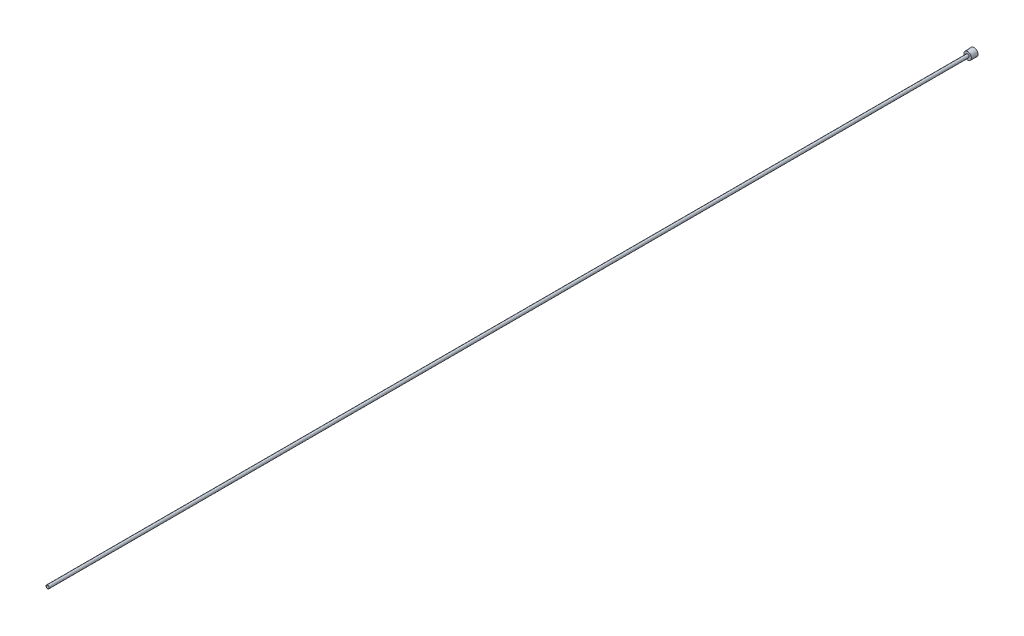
from build123d import *

# Parameters (mm, degrees)
SKETCH2_R          = 1.3843
CUT_EXTRUDE1_DEPTH = 915.416624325
CUT_EXTRUDE2_DEPTH = 3.96875


with BuildPart() as part:
    # Sketch1 → Revolve1 (revolve)
    with BuildSketch(Plane(origin=(0, 0, 0), x_dir=(0, 0, -1), z_dir=(1, 0, 0)), mode=Mode.PRIVATE) as revolve1_sk:
        Polygon((-914.4, 0), (0, 0), (0, 3.8989), (-6.35, 3.667387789), (-6.35, 1.5875), (-914.4, 1.5875), align=None)
    revolve(revolve1_sk.sketch.rotate(Axis((0, 0, 0), (0, 0, -1)), 90), axis=Axis((0, 0, 0), (0, 0, -1)))

    # Sketch2 → Cut-Extrude1 (cut, through all)
    with BuildSketch(Plane.XY.offset(914.4)):
        Circle(SKETCH2_R)
    extrude(amount=-CUT_EXTRUDE1_DEPTH, mode=Mode.SUBTRACT)

    # Sketch3 → Cut-Extrude2 (cut)
    with BuildSketch(Plane(origin=(0, 0, 0), x_dir=(-1, 0, 0), z_dir=(0, 0, -1))):
        Polygon((0, -2.749630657), (2.38125, -1.374815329), (2.38125, 1.374815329), (0, 2.749630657), (-2.38125, 1.374815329), (-2.38125, -1.374815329), align=None)
    extrude(amount=-CUT_EXTRUDE2_DEPTH, mode=Mode.SUBTRACT)


solid = part.part
